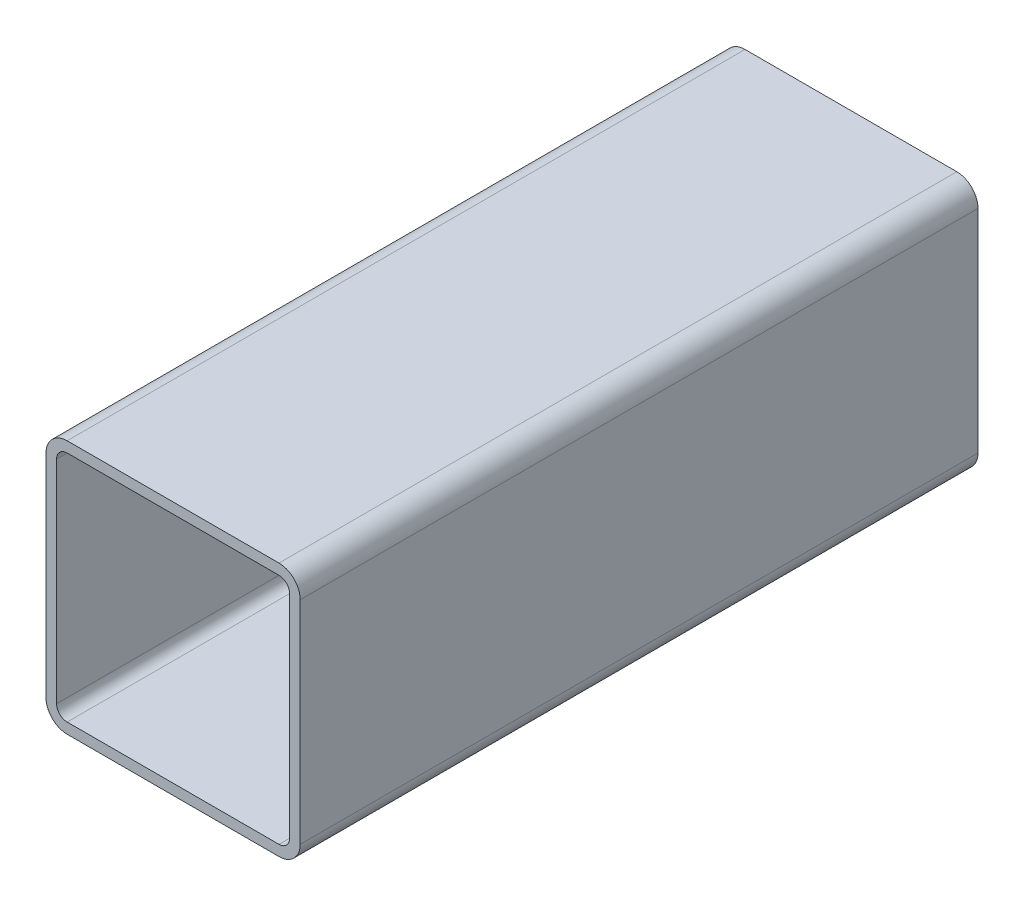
ISO-10303-21;
HEADER;
FILE_DESCRIPTION(('STEP AP214'),'2;1');
FILE_NAME('part.step','',(''),(''),'','','');
FILE_SCHEMA(('AUTOMOTIVE_DESIGN { 1 0 10303 214 1 1 1 1 }'));
ENDSEC;
DATA;
#1=APPLICATION_CONTEXT('core data for automotive mechanical design processes');
#2=APPLICATION_PROTOCOL_DEFINITION('international standard','automotive_design',2000,#1);
#3=PRODUCT_CONTEXT('',#1,'mechanical');
#4=PRODUCT('Part','Part','',(#3));
#5=PRODUCT_RELATED_PRODUCT_CATEGORY('part','',(#4));
#6=PRODUCT_DEFINITION_FORMATION('','',#4);
#7=PRODUCT_DEFINITION_CONTEXT('part definition',#1,'design');
#8=PRODUCT_DEFINITION('design','',#6,#7);
#9=PRODUCT_DEFINITION_SHAPE('','',#8);
#10=(LENGTH_UNIT() NAMED_UNIT(*) SI_UNIT(.MILLI.,.METRE.));
#11=(NAMED_UNIT(*) PLANE_ANGLE_UNIT() SI_UNIT($,.RADIAN.));
#12=(NAMED_UNIT(*) SI_UNIT($,.STERADIAN.) SOLID_ANGLE_UNIT());
#13=UNCERTAINTY_MEASURE_WITH_UNIT(LENGTH_MEASURE(1.E-05),#10,'distance_accuracy_value','');
#14=(GEOMETRIC_REPRESENTATION_CONTEXT(3) GLOBAL_UNCERTAINTY_ASSIGNED_CONTEXT((#13)) GLOBAL_UNIT_ASSIGNED_CONTEXT((#10,
#11,#12)) REPRESENTATION_CONTEXT('',''));
#15=CARTESIAN_POINT('',(0.,0.,0.));
#16=DIRECTION('',(0.,0.,1.));
#17=DIRECTION('',(1.,0.,0.));
#18=AXIS2_PLACEMENT_3D('',#15,#16,#17);
#19=CARTESIAN_POINT('',(10.7932087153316,105.553601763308,304.8));
#20=DIRECTION('',(0.,0.,1.));
#21=DIRECTION('',(1.,0.,0.));
#22=AXIS2_PLACEMENT_3D('',#19,#20,#21);
#23=PLANE('',#22);
#24=CARTESIAN_POINT('',(10.7932087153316,105.553601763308,304.8));
#25=DIRECTION('',(0.,0.,1.));
#26=DIRECTION('',(1.,0.,0.));
#27=AXIS2_PLACEMENT_3D('',#24,#25,#26);
#28=CIRCLE('',#27,9.52500000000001);
#29=CARTESIAN_POINT('',(10.7932087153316,115.078601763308,304.8));
#30=VERTEX_POINT('',#29);
#31=CARTESIAN_POINT('',(1.26820871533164,105.553601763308,304.8));
#32=VERTEX_POINT('',#31);
#33=EDGE_CURVE('E211',#30,#32,#28,.T.);
#34=ORIENTED_EDGE('',*,*,#33,.T.);
#35=DIRECTION('',(0.,-1.,0.));
#36=VECTOR('',#35,1.);
#37=CARTESIAN_POINT('',(1.26820871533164,10.3036017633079,304.8));
#38=LINE('',#37,#36);
#39=CARTESIAN_POINT('',(1.26820871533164,10.3036017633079,304.8));
#40=VERTEX_POINT('',#39);
#41=EDGE_CURVE('E214',#32,#40,#38,.T.);
#42=ORIENTED_EDGE('',*,*,#41,.T.);
#43=CARTESIAN_POINT('',(10.7932087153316,10.3036017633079,304.8));
#44=DIRECTION('',(0.,0.,1.));
#45=DIRECTION('',(1.,0.,0.));
#46=AXIS2_PLACEMENT_3D('',#43,#44,#45);
#47=CIRCLE('',#46,9.525);
#48=CARTESIAN_POINT('',(10.7932087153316,0.77860176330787,304.8));
#49=VERTEX_POINT('',#48);
#50=EDGE_CURVE('E217',#40,#49,#47,.T.);
#51=ORIENTED_EDGE('',*,*,#50,.T.);
#52=DIRECTION('',(1.,0.,0.));
#53=VECTOR('',#52,1.);
#54=CARTESIAN_POINT('',(106.043208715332,0.77860176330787,304.8));
#55=LINE('',#54,#53);
#56=CARTESIAN_POINT('',(106.043208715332,0.778601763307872,304.8));
#57=VERTEX_POINT('',#56);
#58=EDGE_CURVE('E219',#49,#57,#55,.T.);
#59=ORIENTED_EDGE('',*,*,#58,.T.);
#60=CARTESIAN_POINT('',(106.043208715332,10.3036017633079,304.8));
#61=DIRECTION('',(0.,0.,1.));
#62=DIRECTION('',(1.,0.,0.));
#63=AXIS2_PLACEMENT_3D('',#60,#61,#62);
#64=CIRCLE('',#63,9.52499999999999);
#65=CARTESIAN_POINT('',(115.568208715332,10.3036017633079,304.8));
#66=VERTEX_POINT('',#65);
#67=EDGE_CURVE('E221',#57,#66,#64,.T.);
#68=ORIENTED_EDGE('',*,*,#67,.T.);
#69=DIRECTION('',(0.,1.,0.));
#70=VECTOR('',#69,1.);
#71=CARTESIAN_POINT('',(115.568208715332,105.553601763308,304.8));
#72=LINE('',#71,#70);
#73=CARTESIAN_POINT('',(115.568208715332,105.553601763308,304.8));
#74=VERTEX_POINT('',#73);
#75=EDGE_CURVE('E223',#66,#74,#72,.T.);
#76=ORIENTED_EDGE('',*,*,#75,.T.);
#77=CARTESIAN_POINT('',(106.043208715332,105.553601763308,304.8));
#78=DIRECTION('',(0.,0.,1.));
#79=DIRECTION('',(1.,0.,0.));
#80=AXIS2_PLACEMENT_3D('',#77,#78,#79);
#81=CIRCLE('',#80,9.525);
#82=CARTESIAN_POINT('',(106.043208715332,115.078601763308,304.8));
#83=VERTEX_POINT('',#82);
#84=EDGE_CURVE('E225',#74,#83,#81,.T.);
#85=ORIENTED_EDGE('',*,*,#84,.T.);
#86=DIRECTION('',(-1.,0.,0.));
#87=VECTOR('',#86,1.);
#88=CARTESIAN_POINT('',(10.7932087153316,115.078601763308,304.8));
#89=LINE('',#88,#87);
#90=EDGE_CURVE('E227',#83,#30,#89,.T.);
#91=ORIENTED_EDGE('',*,*,#90,.T.);
#92=EDGE_LOOP('',(#34,#42,#51,#59,#68,#76,#85,#91));
#93=FACE_BOUND('',#92,.T.);
#94=DIRECTION('',(0.,-1.,0.));
#95=VECTOR('',#94,1.);
#96=CARTESIAN_POINT('',(6.03070871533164,10.3036017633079,304.8));
#97=LINE('',#96,#95);
#98=CARTESIAN_POINT('',(6.03070871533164,105.553601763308,304.8));
#99=VERTEX_POINT('',#98);
#100=CARTESIAN_POINT('',(6.03070871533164,10.3036017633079,304.8));
#101=VERTEX_POINT('',#100);
#102=EDGE_CURVE('E154',#99,#101,#97,.T.);
#103=ORIENTED_EDGE('',*,*,#102,.F.);
#104=CARTESIAN_POINT('',(10.7932087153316,105.553601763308,304.8));
#105=DIRECTION('',(0.,0.,1.));
#106=DIRECTION('',(1.,0.,0.));
#107=AXIS2_PLACEMENT_3D('',#104,#105,#106);
#108=CIRCLE('',#107,4.7625);
#109=CARTESIAN_POINT('',(10.7932087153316,110.316101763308,304.8));
#110=VERTEX_POINT('',#109);
#111=EDGE_CURVE('E146',#110,#99,#108,.T.);
#112=ORIENTED_EDGE('',*,*,#111,.F.);
#113=DIRECTION('',(-1.,0.,0.));
#114=VECTOR('',#113,1.);
#115=CARTESIAN_POINT('',(10.7932087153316,110.316101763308,304.8));
#116=LINE('',#115,#114);
#117=CARTESIAN_POINT('',(106.043208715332,110.316101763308,304.8));
#118=VERTEX_POINT('',#117);
#119=EDGE_CURVE('E179',#118,#110,#116,.T.);
#120=ORIENTED_EDGE('',*,*,#119,.F.);
#121=CARTESIAN_POINT('',(106.043208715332,105.553601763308,304.8));
#122=DIRECTION('',(0.,0.,1.));
#123=DIRECTION('',(1.,0.,0.));
#124=AXIS2_PLACEMENT_3D('',#121,#122,#123);
#125=CIRCLE('',#124,4.7625);
#126=CARTESIAN_POINT('',(110.805708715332,105.553601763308,304.8));
#127=VERTEX_POINT('',#126);
#128=EDGE_CURVE('E177',#127,#118,#125,.T.);
#129=ORIENTED_EDGE('',*,*,#128,.F.);
#130=DIRECTION('',(0.,1.,0.));
#131=VECTOR('',#130,1.);
#132=CARTESIAN_POINT('',(110.805708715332,105.553601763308,304.8));
#133=LINE('',#132,#131);
#134=CARTESIAN_POINT('',(110.805708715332,10.3036017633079,304.8));
#135=VERTEX_POINT('',#134);
#136=EDGE_CURVE('E175',#135,#127,#133,.T.);
#137=ORIENTED_EDGE('',*,*,#136,.F.);
#138=CARTESIAN_POINT('',(106.043208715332,10.3036017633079,304.8));
#139=DIRECTION('',(0.,0.,1.));
#140=DIRECTION('',(1.,0.,0.));
#141=AXIS2_PLACEMENT_3D('',#138,#139,#140);
#142=CIRCLE('',#141,4.76249999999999);
#143=CARTESIAN_POINT('',(106.043208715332,5.54110176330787,304.8));
#144=VERTEX_POINT('',#143);
#145=EDGE_CURVE('E173',#144,#135,#142,.T.);
#146=ORIENTED_EDGE('',*,*,#145,.F.);
#147=DIRECTION('',(1.,0.,0.));
#148=VECTOR('',#147,1.);
#149=CARTESIAN_POINT('',(106.043208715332,5.54110176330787,304.8));
#150=LINE('',#149,#148);
#151=CARTESIAN_POINT('',(10.7932087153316,5.54110176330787,304.8));
#152=VERTEX_POINT('',#151);
#153=EDGE_CURVE('E169',#152,#144,#150,.T.);
#154=ORIENTED_EDGE('',*,*,#153,.F.);
#155=CARTESIAN_POINT('',(10.7932087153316,10.3036017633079,304.8));
#156=DIRECTION('',(0.,0.,1.));
#157=DIRECTION('',(1.,0.,0.));
#158=AXIS2_PLACEMENT_3D('',#155,#156,#157);
#159=CIRCLE('',#158,4.7625);
#160=EDGE_CURVE('E167',#101,#152,#159,.T.);
#161=ORIENTED_EDGE('',*,*,#160,.F.);
#162=EDGE_LOOP('',(#103,#112,#120,#129,#137,#146,#154,#161));
#163=FACE_BOUND('',#162,.T.);
#164=ADVANCED_FACE('F33',(#93,#163),#23,.T.);
#165=CARTESIAN_POINT('',(10.7932087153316,105.553601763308,0.));
#166=DIRECTION('',(0.,0.,1.));
#167=DIRECTION('',(1.,0.,0.));
#168=AXIS2_PLACEMENT_3D('',#165,#166,#167);
#169=PLANE('',#168);
#170=CARTESIAN_POINT('',(10.7932087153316,105.553601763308,0.));
#171=DIRECTION('',(0.,0.,1.));
#172=DIRECTION('',(1.,0.,0.));
#173=AXIS2_PLACEMENT_3D('',#170,#171,#172);
#174=CIRCLE('',#173,9.52500000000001);
#175=CARTESIAN_POINT('',(10.7932087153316,115.078601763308,0.));
#176=VERTEX_POINT('',#175);
#177=CARTESIAN_POINT('',(1.26820871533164,105.553601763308,0.));
#178=VERTEX_POINT('',#177);
#179=EDGE_CURVE('E162',#176,#178,#174,.T.);
#180=ORIENTED_EDGE('',*,*,#179,.F.);
#181=DIRECTION('',(-1.,0.,0.));
#182=VECTOR('',#181,1.);
#183=CARTESIAN_POINT('',(10.7932087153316,115.078601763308,0.));
#184=LINE('',#183,#182);
#185=CARTESIAN_POINT('',(106.043208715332,115.078601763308,0.));
#186=VERTEX_POINT('',#185);
#187=EDGE_CURVE('E215',#186,#176,#184,.T.);
#188=ORIENTED_EDGE('',*,*,#187,.F.);
#189=CARTESIAN_POINT('',(106.043208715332,105.553601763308,0.));
#190=DIRECTION('',(0.,0.,1.));
#191=DIRECTION('',(1.,0.,0.));
#192=AXIS2_PLACEMENT_3D('',#189,#190,#191);
#193=CIRCLE('',#192,9.525);
#194=CARTESIAN_POINT('',(115.568208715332,105.553601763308,0.));
#195=VERTEX_POINT('',#194);
#196=EDGE_CURVE('E242',#195,#186,#193,.T.);
#197=ORIENTED_EDGE('',*,*,#196,.F.);
#198=DIRECTION('',(0.,1.,0.));
#199=VECTOR('',#198,1.);
#200=CARTESIAN_POINT('',(115.568208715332,105.553601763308,0.));
#201=LINE('',#200,#199);
#202=CARTESIAN_POINT('',(115.568208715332,10.3036017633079,0.));
#203=VERTEX_POINT('',#202);
#204=EDGE_CURVE('E240',#203,#195,#201,.T.);
#205=ORIENTED_EDGE('',*,*,#204,.F.);
#206=CARTESIAN_POINT('',(106.043208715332,10.3036017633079,0.));
#207=DIRECTION('',(0.,0.,1.));
#208=DIRECTION('',(1.,0.,0.));
#209=AXIS2_PLACEMENT_3D('',#206,#207,#208);
#210=CIRCLE('',#209,9.52499999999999);
#211=CARTESIAN_POINT('',(106.043208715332,0.778601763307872,0.));
#212=VERTEX_POINT('',#211);
#213=EDGE_CURVE('E238',#212,#203,#210,.T.);
#214=ORIENTED_EDGE('',*,*,#213,.F.);
#215=DIRECTION('',(1.,0.,0.));
#216=VECTOR('',#215,1.);
#217=CARTESIAN_POINT('',(106.043208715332,0.77860176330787,0.));
#218=LINE('',#217,#216);
#219=CARTESIAN_POINT('',(10.7932087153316,0.77860176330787,0.));
#220=VERTEX_POINT('',#219);
#221=EDGE_CURVE('E236',#220,#212,#218,.T.);
#222=ORIENTED_EDGE('',*,*,#221,.F.);
#223=CARTESIAN_POINT('',(10.7932087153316,10.3036017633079,0.));
#224=DIRECTION('',(0.,0.,1.));
#225=DIRECTION('',(1.,0.,0.));
#226=AXIS2_PLACEMENT_3D('',#223,#224,#225);
#227=CIRCLE('',#226,9.525);
#228=CARTESIAN_POINT('',(1.26820871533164,10.3036017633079,0.));
#229=VERTEX_POINT('',#228);
#230=EDGE_CURVE('E234',#229,#220,#227,.T.);
#231=ORIENTED_EDGE('',*,*,#230,.F.);
#232=DIRECTION('',(0.,-1.,0.));
#233=VECTOR('',#232,1.);
#234=CARTESIAN_POINT('',(1.26820871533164,10.3036017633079,0.));
#235=LINE('',#234,#233);
#236=EDGE_CURVE('E232',#178,#229,#235,.T.);
#237=ORIENTED_EDGE('',*,*,#236,.F.);
#238=EDGE_LOOP('',(#180,#188,#197,#205,#214,#222,#231,#237));
#239=FACE_BOUND('',#238,.T.);
#240=CARTESIAN_POINT('',(10.7932087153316,105.553601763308,0.));
#241=DIRECTION('',(0.,0.,1.));
#242=DIRECTION('',(1.,0.,0.));
#243=AXIS2_PLACEMENT_3D('',#240,#241,#242);
#244=CIRCLE('',#243,4.7625);
#245=CARTESIAN_POINT('',(10.7932087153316,110.316101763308,0.));
#246=VERTEX_POINT('',#245);
#247=CARTESIAN_POINT('',(6.03070871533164,105.553601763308,0.));
#248=VERTEX_POINT('',#247);
#249=EDGE_CURVE('E56',#246,#248,#244,.T.);
#250=ORIENTED_EDGE('',*,*,#249,.T.);
#251=DIRECTION('',(0.,-1.,0.));
#252=VECTOR('',#251,1.);
#253=CARTESIAN_POINT('',(6.03070871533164,10.3036017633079,0.));
#254=LINE('',#253,#252);
#255=CARTESIAN_POINT('',(6.03070871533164,10.3036017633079,0.));
#256=VERTEX_POINT('',#255);
#257=EDGE_CURVE('E161',#248,#256,#254,.T.);
#258=ORIENTED_EDGE('',*,*,#257,.T.);
#259=CARTESIAN_POINT('',(10.7932087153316,10.3036017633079,0.));
#260=DIRECTION('',(0.,0.,1.));
#261=DIRECTION('',(1.,0.,0.));
#262=AXIS2_PLACEMENT_3D('',#259,#260,#261);
#263=CIRCLE('',#262,4.7625);
#264=CARTESIAN_POINT('',(10.7932087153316,5.54110176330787,0.));
#265=VERTEX_POINT('',#264);
#266=EDGE_CURVE('E183',#256,#265,#263,.T.);
#267=ORIENTED_EDGE('',*,*,#266,.T.);
#268=DIRECTION('',(1.,0.,0.));
#269=VECTOR('',#268,1.);
#270=CARTESIAN_POINT('',(106.043208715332,5.54110176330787,0.));
#271=LINE('',#270,#269);
#272=CARTESIAN_POINT('',(106.043208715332,5.54110176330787,0.));
#273=VERTEX_POINT('',#272);
#274=EDGE_CURVE('E186',#265,#273,#271,.T.);
#275=ORIENTED_EDGE('',*,*,#274,.T.);
#276=CARTESIAN_POINT('',(106.043208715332,10.3036017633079,0.));
#277=DIRECTION('',(0.,0.,1.));
#278=DIRECTION('',(1.,0.,0.));
#279=AXIS2_PLACEMENT_3D('',#276,#277,#278);
#280=CIRCLE('',#279,4.76249999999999);
#281=CARTESIAN_POINT('',(110.805708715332,10.3036017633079,0.));
#282=VERTEX_POINT('',#281);
#283=EDGE_CURVE('E189',#273,#282,#280,.T.);
#284=ORIENTED_EDGE('',*,*,#283,.T.);
#285=DIRECTION('',(0.,1.,0.));
#286=VECTOR('',#285,1.);
#287=CARTESIAN_POINT('',(110.805708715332,105.553601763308,0.));
#288=LINE('',#287,#286);
#289=CARTESIAN_POINT('',(110.805708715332,105.553601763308,0.));
#290=VERTEX_POINT('',#289);
#291=EDGE_CURVE('E192',#282,#290,#288,.T.);
#292=ORIENTED_EDGE('',*,*,#291,.T.);
#293=CARTESIAN_POINT('',(106.043208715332,105.553601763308,0.));
#294=DIRECTION('',(0.,0.,1.));
#295=DIRECTION('',(1.,0.,0.));
#296=AXIS2_PLACEMENT_3D('',#293,#294,#295);
#297=CIRCLE('',#296,4.7625);
#298=CARTESIAN_POINT('',(106.043208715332,110.316101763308,0.));
#299=VERTEX_POINT('',#298);
#300=EDGE_CURVE('E195',#290,#299,#297,.T.);
#301=ORIENTED_EDGE('',*,*,#300,.T.);
#302=DIRECTION('',(-1.,0.,0.));
#303=VECTOR('',#302,1.);
#304=CARTESIAN_POINT('',(10.7932087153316,110.316101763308,0.));
#305=LINE('',#304,#303);
#306=EDGE_CURVE('E155',#299,#246,#305,.T.);
#307=ORIENTED_EDGE('',*,*,#306,.T.);
#308=EDGE_LOOP('',(#250,#258,#267,#275,#284,#292,#301,#307));
#309=FACE_BOUND('',#308,.T.);
#310=ADVANCED_FACE('F272',(#239,#309),#169,.F.);
#311=CARTESIAN_POINT('',(10.7932087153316,105.553601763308,304.8));
#312=DIRECTION('',(0.,0.,-1.));
#313=DIRECTION('',(-1.,0.,0.));
#314=AXIS2_PLACEMENT_3D('',#311,#312,#313);
#315=CYLINDRICAL_SURFACE('',#314,9.52500000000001);
#316=ORIENTED_EDGE('',*,*,#179,.T.);
#317=DIRECTION('',(0.,0.,-1.));
#318=VECTOR('',#317,1.);
#319=CARTESIAN_POINT('',(1.26820871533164,105.553601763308,304.8));
#320=LINE('',#319,#318);
#321=EDGE_CURVE('E11',#32,#178,#320,.T.);
#322=ORIENTED_EDGE('',*,*,#321,.F.);
#323=ORIENTED_EDGE('',*,*,#33,.F.);
#324=DIRECTION('',(0.,0.,-1.));
#325=VECTOR('',#324,1.);
#326=CARTESIAN_POINT('',(10.7932087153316,115.078601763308,304.8));
#327=LINE('',#326,#325);
#328=EDGE_CURVE('E229',#30,#176,#327,.T.);
#329=ORIENTED_EDGE('',*,*,#328,.T.);
#330=EDGE_LOOP('',(#316,#322,#323,#329));
#331=FACE_BOUND('',#330,.T.);
#332=ADVANCED_FACE('F35',(#331),#315,.T.);
#333=CARTESIAN_POINT('',(1.26820871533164,10.3036017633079,304.8));
#334=DIRECTION('',(1.,0.,0.));
#335=DIRECTION('',(0.,0.,-1.));
#336=AXIS2_PLACEMENT_3D('',#333,#334,#335);
#337=PLANE('',#336);
#338=ORIENTED_EDGE('',*,*,#236,.T.);
#339=DIRECTION('',(0.,0.,-1.));
#340=VECTOR('',#339,1.);
#341=CARTESIAN_POINT('',(1.26820871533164,10.3036017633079,304.8));
#342=LINE('',#341,#340);
#343=EDGE_CURVE('E41',#40,#229,#342,.T.);
#344=ORIENTED_EDGE('',*,*,#343,.F.);
#345=ORIENTED_EDGE('',*,*,#41,.F.);
#346=ORIENTED_EDGE('',*,*,#321,.T.);
#347=EDGE_LOOP('',(#338,#344,#345,#346));
#348=FACE_BOUND('',#347,.T.);
#349=ADVANCED_FACE('F289',(#348),#337,.F.);
#350=CARTESIAN_POINT('',(10.7932087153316,10.3036017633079,304.8));
#351=DIRECTION('',(0.,0.,-1.));
#352=DIRECTION('',(-1.,0.,0.));
#353=AXIS2_PLACEMENT_3D('',#350,#351,#352);
#354=CYLINDRICAL_SURFACE('',#353,9.525);
#355=ORIENTED_EDGE('',*,*,#230,.T.);
#356=DIRECTION('',(0.,0.,-1.));
#357=VECTOR('',#356,1.);
#358=CARTESIAN_POINT('',(10.7932087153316,0.77860176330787,304.8));
#359=LINE('',#358,#357);
#360=EDGE_CURVE('E259',#49,#220,#359,.T.);
#361=ORIENTED_EDGE('',*,*,#360,.F.);
#362=ORIENTED_EDGE('',*,*,#50,.F.);
#363=ORIENTED_EDGE('',*,*,#343,.T.);
#364=EDGE_LOOP('',(#355,#361,#362,#363));
#365=FACE_BOUND('',#364,.T.);
#366=ADVANCED_FACE('F266',(#365),#354,.T.);
#367=CARTESIAN_POINT('',(106.043208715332,0.77860176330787,304.8));
#368=DIRECTION('',(0.,1.,0.));
#369=DIRECTION('',(0.,0.,1.));
#370=AXIS2_PLACEMENT_3D('',#367,#368,#369);
#371=PLANE('',#370);
#372=ORIENTED_EDGE('',*,*,#221,.T.);
#373=DIRECTION('',(0.,0.,-1.));
#374=VECTOR('',#373,1.);
#375=CARTESIAN_POINT('',(106.043208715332,0.778601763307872,304.8));
#376=LINE('',#375,#374);
#377=EDGE_CURVE('E256',#57,#212,#376,.T.);
#378=ORIENTED_EDGE('',*,*,#377,.F.);
#379=ORIENTED_EDGE('',*,*,#58,.F.);
#380=ORIENTED_EDGE('',*,*,#360,.T.);
#381=EDGE_LOOP('',(#372,#378,#379,#380));
#382=FACE_BOUND('',#381,.T.);
#383=ADVANCED_FACE('F278',(#382),#371,.F.);
#384=CARTESIAN_POINT('',(106.043208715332,10.3036017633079,304.8));
#385=DIRECTION('',(0.,0.,-1.));
#386=DIRECTION('',(-1.,0.,0.));
#387=AXIS2_PLACEMENT_3D('',#384,#385,#386);
#388=CYLINDRICAL_SURFACE('',#387,9.52499999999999);
#389=ORIENTED_EDGE('',*,*,#213,.T.);
#390=DIRECTION('',(0.,0.,-1.));
#391=VECTOR('',#390,1.);
#392=CARTESIAN_POINT('',(115.568208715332,10.3036017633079,304.8));
#393=LINE('',#392,#391);
#394=EDGE_CURVE('E253',#66,#203,#393,.T.);
#395=ORIENTED_EDGE('',*,*,#394,.F.);
#396=ORIENTED_EDGE('',*,*,#67,.F.);
#397=ORIENTED_EDGE('',*,*,#377,.T.);
#398=EDGE_LOOP('',(#389,#395,#396,#397));
#399=FACE_BOUND('',#398,.T.);
#400=ADVANCED_FACE('F282',(#399),#388,.T.);
#401=CARTESIAN_POINT('',(115.568208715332,105.553601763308,304.8));
#402=DIRECTION('',(-1.,0.,0.));
#403=DIRECTION('',(0.,0.,1.));
#404=AXIS2_PLACEMENT_3D('',#401,#402,#403);
#405=PLANE('',#404);
#406=ORIENTED_EDGE('',*,*,#204,.T.);
#407=DIRECTION('',(0.,0.,-1.));
#408=VECTOR('',#407,1.);
#409=CARTESIAN_POINT('',(115.568208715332,105.553601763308,304.8));
#410=LINE('',#409,#408);
#411=EDGE_CURVE('E250',#74,#195,#410,.T.);
#412=ORIENTED_EDGE('',*,*,#411,.F.);
#413=ORIENTED_EDGE('',*,*,#75,.F.);
#414=ORIENTED_EDGE('',*,*,#394,.T.);
#415=EDGE_LOOP('',(#406,#412,#413,#414));
#416=FACE_BOUND('',#415,.T.);
#417=ADVANCED_FACE('F302',(#416),#405,.F.);
#418=CARTESIAN_POINT('',(106.043208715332,105.553601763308,304.8));
#419=DIRECTION('',(0.,0.,-1.));
#420=DIRECTION('',(-1.,0.,0.));
#421=AXIS2_PLACEMENT_3D('',#418,#419,#420);
#422=CYLINDRICAL_SURFACE('',#421,9.525);
#423=ORIENTED_EDGE('',*,*,#196,.T.);
#424=DIRECTION('',(0.,0.,-1.));
#425=VECTOR('',#424,1.);
#426=CARTESIAN_POINT('',(106.043208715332,115.078601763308,304.8));
#427=LINE('',#426,#425);
#428=EDGE_CURVE('E247',#83,#186,#427,.T.);
#429=ORIENTED_EDGE('',*,*,#428,.F.);
#430=ORIENTED_EDGE('',*,*,#84,.F.);
#431=ORIENTED_EDGE('',*,*,#411,.T.);
#432=EDGE_LOOP('',(#423,#429,#430,#431));
#433=FACE_BOUND('',#432,.T.);
#434=ADVANCED_FACE('F300',(#433),#422,.T.);
#435=CARTESIAN_POINT('',(10.7932087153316,115.078601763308,304.8));
#436=DIRECTION('',(0.,-1.,0.));
#437=DIRECTION('',(0.,0.,-1.));
#438=AXIS2_PLACEMENT_3D('',#435,#436,#437);
#439=PLANE('',#438);
#440=ORIENTED_EDGE('',*,*,#187,.T.);
#441=ORIENTED_EDGE('',*,*,#328,.F.);
#442=ORIENTED_EDGE('',*,*,#90,.F.);
#443=ORIENTED_EDGE('',*,*,#428,.T.);
#444=EDGE_LOOP('',(#440,#441,#442,#443));
#445=FACE_BOUND('',#444,.T.);
#446=ADVANCED_FACE('F295',(#445),#439,.F.);
#447=CARTESIAN_POINT('',(10.7932087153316,105.553601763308,304.8));
#448=DIRECTION('',(0.,0.,-1.));
#449=DIRECTION('',(-1.,0.,0.));
#450=AXIS2_PLACEMENT_3D('',#447,#448,#449);
#451=CYLINDRICAL_SURFACE('',#450,4.7625);
#452=ORIENTED_EDGE('',*,*,#249,.F.);
#453=DIRECTION('',(0.,0.,-1.));
#454=VECTOR('',#453,1.);
#455=CARTESIAN_POINT('',(10.7932087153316,110.316101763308,304.8));
#456=LINE('',#455,#454);
#457=EDGE_CURVE('E150',#110,#246,#456,.T.);
#458=ORIENTED_EDGE('',*,*,#457,.F.);
#459=ORIENTED_EDGE('',*,*,#111,.T.);
#460=DIRECTION('',(0.,0.,-1.));
#461=VECTOR('',#460,1.);
#462=CARTESIAN_POINT('',(6.03070871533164,105.553601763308,304.8));
#463=LINE('',#462,#461);
#464=EDGE_CURVE('E149',#99,#248,#463,.T.);
#465=ORIENTED_EDGE('',*,*,#464,.T.);
#466=EDGE_LOOP('',(#452,#458,#459,#465));
#467=FACE_BOUND('',#466,.T.);
#468=ADVANCED_FACE('F148',(#467),#451,.F.);
#469=CARTESIAN_POINT('',(6.03070871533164,10.3036017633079,304.8));
#470=DIRECTION('',(1.,0.,0.));
#471=DIRECTION('',(0.,0.,-1.));
#472=AXIS2_PLACEMENT_3D('',#469,#470,#471);
#473=PLANE('',#472);
#474=ORIENTED_EDGE('',*,*,#257,.F.);
#475=ORIENTED_EDGE('',*,*,#464,.F.);
#476=ORIENTED_EDGE('',*,*,#102,.T.);
#477=DIRECTION('',(0.,0.,-1.));
#478=VECTOR('',#477,1.);
#479=CARTESIAN_POINT('',(6.03070871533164,10.3036017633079,304.8));
#480=LINE('',#479,#478);
#481=EDGE_CURVE('E163',#101,#256,#480,.T.);
#482=ORIENTED_EDGE('',*,*,#481,.T.);
#483=EDGE_LOOP('',(#474,#475,#476,#482));
#484=FACE_BOUND('',#483,.T.);
#485=ADVANCED_FACE('F158',(#484),#473,.T.);
#486=CARTESIAN_POINT('',(10.7932087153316,10.3036017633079,304.8));
#487=DIRECTION('',(0.,0.,-1.));
#488=DIRECTION('',(-1.,0.,0.));
#489=AXIS2_PLACEMENT_3D('',#486,#487,#488);
#490=CYLINDRICAL_SURFACE('',#489,4.7625);
#491=ORIENTED_EDGE('',*,*,#266,.F.);
#492=ORIENTED_EDGE('',*,*,#481,.F.);
#493=ORIENTED_EDGE('',*,*,#160,.T.);
#494=DIRECTION('',(0.,0.,-1.));
#495=VECTOR('',#494,1.);
#496=CARTESIAN_POINT('',(10.7932087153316,5.54110176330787,304.8));
#497=LINE('',#496,#495);
#498=EDGE_CURVE('E208',#152,#265,#497,.T.);
#499=ORIENTED_EDGE('',*,*,#498,.T.);
#500=EDGE_LOOP('',(#491,#492,#493,#499));
#501=FACE_BOUND('',#500,.T.);
#502=ADVANCED_FACE('F327',(#501),#490,.F.);
#503=CARTESIAN_POINT('',(106.043208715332,5.54110176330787,304.8));
#504=DIRECTION('',(0.,1.,0.));
#505=DIRECTION('',(0.,0.,1.));
#506=AXIS2_PLACEMENT_3D('',#503,#504,#505);
#507=PLANE('',#506);
#508=ORIENTED_EDGE('',*,*,#274,.F.);
#509=ORIENTED_EDGE('',*,*,#498,.F.);
#510=ORIENTED_EDGE('',*,*,#153,.T.);
#511=DIRECTION('',(0.,0.,-1.));
#512=VECTOR('',#511,1.);
#513=CARTESIAN_POINT('',(106.043208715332,5.54110176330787,304.8));
#514=LINE('',#513,#512);
#515=EDGE_CURVE('E206',#144,#273,#514,.T.);
#516=ORIENTED_EDGE('',*,*,#515,.T.);
#517=EDGE_LOOP('',(#508,#509,#510,#516));
#518=FACE_BOUND('',#517,.T.);
#519=ADVANCED_FACE('F331',(#518),#507,.T.);
#520=CARTESIAN_POINT('',(106.043208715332,10.3036017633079,304.8));
#521=DIRECTION('',(0.,0.,-1.));
#522=DIRECTION('',(-1.,0.,0.));
#523=AXIS2_PLACEMENT_3D('',#520,#521,#522);
#524=CYLINDRICAL_SURFACE('',#523,4.76249999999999);
#525=ORIENTED_EDGE('',*,*,#283,.F.);
#526=ORIENTED_EDGE('',*,*,#515,.F.);
#527=ORIENTED_EDGE('',*,*,#145,.T.);
#528=DIRECTION('',(0.,0.,-1.));
#529=VECTOR('',#528,1.);
#530=CARTESIAN_POINT('',(110.805708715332,10.3036017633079,304.8));
#531=LINE('',#530,#529);
#532=EDGE_CURVE('E204',#135,#282,#531,.T.);
#533=ORIENTED_EDGE('',*,*,#532,.T.);
#534=EDGE_LOOP('',(#525,#526,#527,#533));
#535=FACE_BOUND('',#534,.T.);
#536=ADVANCED_FACE('F337',(#535),#524,.F.);
#537=CARTESIAN_POINT('',(110.805708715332,105.553601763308,304.8));
#538=DIRECTION('',(-1.,0.,0.));
#539=DIRECTION('',(0.,0.,1.));
#540=AXIS2_PLACEMENT_3D('',#537,#538,#539);
#541=PLANE('',#540);
#542=ORIENTED_EDGE('',*,*,#291,.F.);
#543=ORIENTED_EDGE('',*,*,#532,.F.);
#544=ORIENTED_EDGE('',*,*,#136,.T.);
#545=DIRECTION('',(0.,0.,-1.));
#546=VECTOR('',#545,1.);
#547=CARTESIAN_POINT('',(110.805708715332,105.553601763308,304.8));
#548=LINE('',#547,#546);
#549=EDGE_CURVE('E202',#127,#290,#548,.T.);
#550=ORIENTED_EDGE('',*,*,#549,.T.);
#551=EDGE_LOOP('',(#542,#543,#544,#550));
#552=FACE_BOUND('',#551,.T.);
#553=ADVANCED_FACE('F341',(#552),#541,.T.);
#554=CARTESIAN_POINT('',(106.043208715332,105.553601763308,304.8));
#555=DIRECTION('',(0.,0.,-1.));
#556=DIRECTION('',(-1.,0.,0.));
#557=AXIS2_PLACEMENT_3D('',#554,#555,#556);
#558=CYLINDRICAL_SURFACE('',#557,4.7625);
#559=ORIENTED_EDGE('',*,*,#300,.F.);
#560=ORIENTED_EDGE('',*,*,#549,.F.);
#561=ORIENTED_EDGE('',*,*,#128,.T.);
#562=DIRECTION('',(0.,0.,-1.));
#563=VECTOR('',#562,1.);
#564=CARTESIAN_POINT('',(106.043208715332,110.316101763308,304.8));
#565=LINE('',#564,#563);
#566=EDGE_CURVE('E48',#118,#299,#565,.T.);
#567=ORIENTED_EDGE('',*,*,#566,.T.);
#568=EDGE_LOOP('',(#559,#560,#561,#567));
#569=FACE_BOUND('',#568,.T.);
#570=ADVANCED_FACE('F345',(#569),#558,.F.);
#571=CARTESIAN_POINT('',(10.7932087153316,110.316101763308,304.8));
#572=DIRECTION('',(0.,-1.,0.));
#573=DIRECTION('',(0.,0.,-1.));
#574=AXIS2_PLACEMENT_3D('',#571,#572,#573);
#575=PLANE('',#574);
#576=ORIENTED_EDGE('',*,*,#306,.F.);
#577=ORIENTED_EDGE('',*,*,#566,.F.);
#578=ORIENTED_EDGE('',*,*,#119,.T.);
#579=ORIENTED_EDGE('',*,*,#457,.T.);
#580=EDGE_LOOP('',(#576,#577,#578,#579));
#581=FACE_BOUND('',#580,.T.);
#582=ADVANCED_FACE('F349',(#581),#575,.T.);
#583=CLOSED_SHELL('',(#164,#310,#332,#349,#366,#383,#400,#417,#434,#446,#468,#485,#502,#519,
#536,#553,#570,#582));
#584=MANIFOLD_SOLID_BREP('B2',#583);
#585=ADVANCED_BREP_SHAPE_REPRESENTATION('',(#18,#584),#14);
#586=SHAPE_DEFINITION_REPRESENTATION(#9,#585);
ENDSEC;
END-ISO-10303-21;
